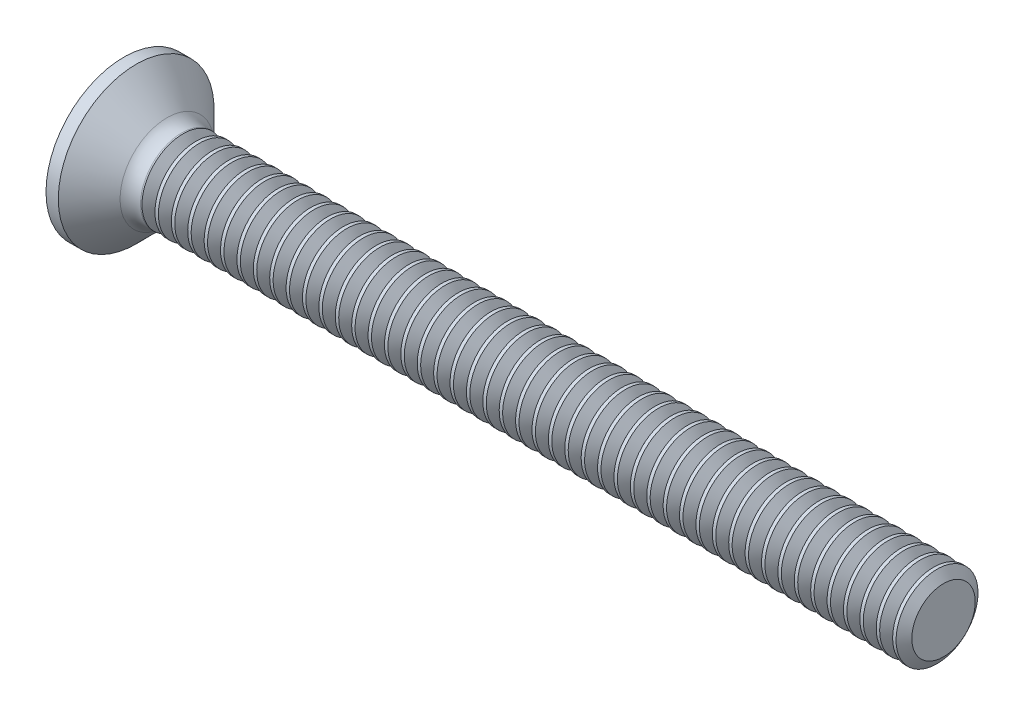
from build123d import *

# Parameters (mm, degrees)
FILLET1_R       = 0.5
RECPAT_COUNT    = 2
RECPAT_ANGLE    = 90
THDSCHPAT_COUNT = 47
THDSCHPAT_PITCH = 0.4


with BuildPart() as part:
    # BodySke → Base-Revolve (revolve)
    with BuildSketch(Plane.XY, mode=Mode.PRIVATE) as base_revolve_sk:
        Polygon((0, 0), (0, 1.9), (0.3, 1.9), (1.2, 1), (20, 1), (20, 0), align=None)
    revolve(base_revolve_sk.sketch.rotate(Axis((-6.35, 0, 0), (1, 0, 0)), 90), axis=Axis((-6.35, 0, 0), (1, 0, 0)))

    # Fillet1
    fillet1_edges = [part.edges().sort_by_distance(p)[0] for p in [
        (1.2, 0, -1),
    ]]
    fillet(fillet1_edges, radius=FILLET1_R)

    # Sketch3 → Recess section 0
    with BuildSketch(Plane.ZY):
        with BuildLine():
            Line((-0.24, 0.95), (0.24, 0.95))
            Line((0.24, 0.95), (0.24, -0.95))
            Line((0.24, -0.95), (-0.24, -0.95))
            Line((-0.24, -0.95), (-0.24, 0.95))
        make_face()
    # Sketch4 → Recess section 1
    with BuildSketch(Plane.ZY.offset(-1.2)):
        with BuildLine():
            Line((-0.24, 0.35170217), (0.24, 0.35170217))
            Line((0.24, 0.35170217), (0.24, -0.35170217))
            Line((0.24, -0.35170217), (-0.24, -0.35170217))
            Line((-0.24, -0.35170217), (-0.24, 0.35170217))
        make_face()
    recess = loft(mode=Mode.SUBTRACT)

    # RecPat: Recess ×2 about axis
    recpat_axis = Axis((0, 0, 0), (1, 0, 0))
    for i in range(1, RECPAT_COUNT):
        add(recess.rotate(recpat_axis, i * RECPAT_ANGLE / (RECPAT_COUNT - 1)), mode=Mode.SUBTRACT)

    # RecCorSke → RecessCore (revolve, cut)
    with BuildSketch(Plane.XY, mode=Mode.PRIVATE) as recesscore_sk:
        Polygon((0, 0), (0, 0.439412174), (1.2, 0.3555), (1.315508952, 0), align=None)
    revolve(recesscore_sk.sketch.rotate(Axis((-3.175, 0, 0), (1, 0, 0)), 90), axis=Axis((-3.175, 0, 0), (1, 0, 0)), mode=Mode.SUBTRACT)

    # ThdSchSke → ThreadSchematic (revolve, cut)
    with BuildSketch(Plane.XY, mode=Mode.PRIVATE) as threadschematic_sk:
        Polygon((1.600001, -0.774), (1.441754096, -1), (1.441754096, -1.25), (1.758247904, -1.25), (1.758247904, -1), align=None)
    threadschematic = revolve(threadschematic_sk.sketch.rotate(Axis((-3.175, 0, 0), (1, 0, 0)), 270), axis=Axis((-3.175, 0, 0), (1, 0, 0)), mode=Mode.SUBTRACT)

    # ThdSchPat: ThreadSchematic ×47
    with Locations(*[(i * THDSCHPAT_PITCH, 0, 0) for i in range(1, THDSCHPAT_COUNT)]):
        add(threadschematic, mode=Mode.SUBTRACT)


solid = part.part
